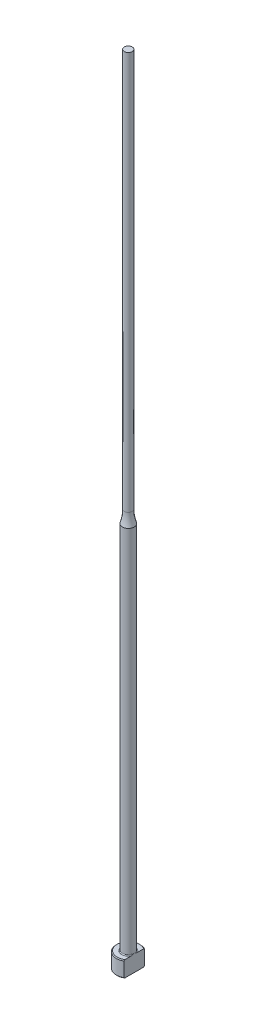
from build123d import *
from build123d.topology import SkipClean

# Parameters (mm, degrees)
CHAMFER1_SIZE    = 0.2
FILLET1_R        = 0.2
KEYED_HEAD_DEPTH = 201.044994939


with BuildPart() as part:
    # Sketch1 → Revolve1 (revolve)
    with BuildSketch(Plane.XY, mode=Mode.PRIVATE) as revolve1_sk:
        with BuildLine():
            Line((0, 0), (-3, 0))
            Line((-3, 0), (-3, 4))
            Line((-3, 4), (-1.5, 4))
            Line((-1.5, 4), (-1.5, 96.877501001))
            ThreePointArc((-1.5, 96.877501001), (-1.125791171, 98.41886117), (-1, 100))
            Line((-1, 100), (-1, 200))
            Line((-1, 200), (0, 200))
            Line((0, 200), (0, 0))
        make_face()
    revolve(revolve1_sk.sketch.rotate(Axis((0, 259.958771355, 0), (0, -1, 0)), 270), axis=Axis((0, 259.958771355, 0), (0, -1, 0)))

    # Chamfer1
    chamfer1_edges = [part.edges().sort_by_distance(p)[0] for p in [
        (0, 0, -3),
        (0, 4, -3),
    ]]
    chamfer(chamfer1_edges, length=CHAMFER1_SIZE)

    # Fillet1
    fillet1_edges = [part.edges().sort_by_distance(p)[0] for p in [
        (0, 4, -1.5),
    ]]
    fillet(fillet1_edges, radius=FILLET1_R)

    # Sketch2 → Keyed Head (cut, through all)
    with SkipClean():  # the faces are left unmerged after this step: merging them gives an invalid solid
        with BuildSketch(Plane(origin=(0, 0, 0), x_dir=(1, 0, 0), z_dir=(0, 1, 0))):
            with BuildLine():
                Line((1.5, -2.598076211), (1.5, 2.598076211))
                ThreePointArc((1.5, 2.598076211), (3, 0), (1.5, -2.598076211))
            make_face()
        extrude(amount=KEYED_HEAD_DEPTH, mode=Mode.SUBTRACT)


solid = part.part
